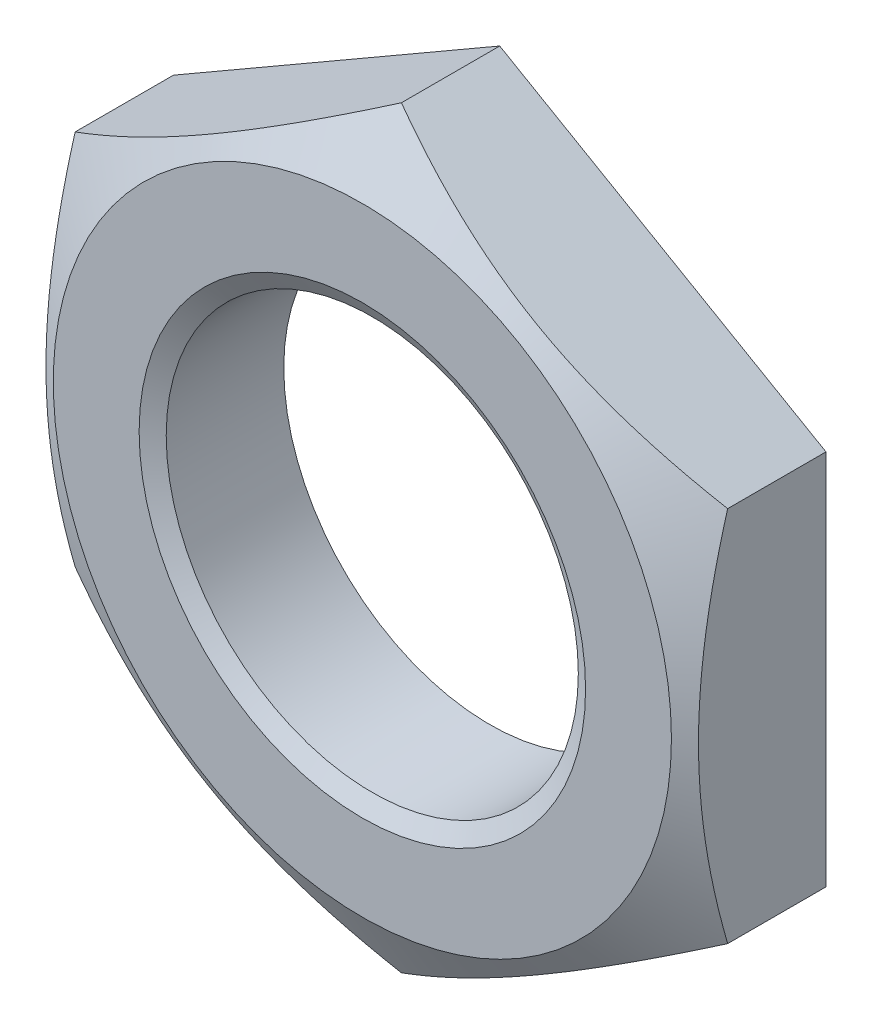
ISO-10303-21;
HEADER;
FILE_DESCRIPTION(('STEP AP214'),'2;1');
FILE_NAME('part.step','',(''),(''),'','','');
FILE_SCHEMA(('AUTOMOTIVE_DESIGN { 1 0 10303 214 1 1 1 1 }'));
ENDSEC;
DATA;
#1=APPLICATION_CONTEXT('core data for automotive mechanical design processes');
#2=APPLICATION_PROTOCOL_DEFINITION('international standard','automotive_design',2000,#1);
#3=PRODUCT_CONTEXT('',#1,'mechanical');
#4=PRODUCT('Part','Part','',(#3));
#5=PRODUCT_RELATED_PRODUCT_CATEGORY('part','',(#4));
#6=PRODUCT_DEFINITION_FORMATION('','',#4);
#7=PRODUCT_DEFINITION_CONTEXT('part definition',#1,'design');
#8=PRODUCT_DEFINITION('design','',#6,#7);
#9=PRODUCT_DEFINITION_SHAPE('','',#8);
#10=(LENGTH_UNIT() NAMED_UNIT(*) SI_UNIT(.MILLI.,.METRE.));
#11=(NAMED_UNIT(*) PLANE_ANGLE_UNIT() SI_UNIT($,.RADIAN.));
#12=(NAMED_UNIT(*) SI_UNIT($,.STERADIAN.) SOLID_ANGLE_UNIT());
#13=UNCERTAINTY_MEASURE_WITH_UNIT(LENGTH_MEASURE(1.E-05),#10,'distance_accuracy_value','');
#14=(GEOMETRIC_REPRESENTATION_CONTEXT(3) GLOBAL_UNCERTAINTY_ASSIGNED_CONTEXT((#13)) GLOBAL_UNIT_ASSIGNED_CONTEXT((#10,
#11,#12)) REPRESENTATION_CONTEXT('',''));
#15=CARTESIAN_POINT('',(0.,0.,0.));
#16=DIRECTION('',(0.,0.,1.));
#17=DIRECTION('',(1.,0.,0.));
#18=AXIS2_PLACEMENT_3D('',#15,#16,#17);
#19=CARTESIAN_POINT('',(9.5,5.48482755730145,4.));
#20=DIRECTION('',(-0.5,-0.866025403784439,0.));
#21=DIRECTION('',(0.866025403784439,-0.5,0.));
#22=AXIS2_PLACEMENT_3D('',#19,#20,#21);
#23=PLANE('',#22);
#24=CARTESIAN_POINT('',(9.5002,5.48471208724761,2.86275242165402));
#25=CARTESIAN_POINT('',(9.2913692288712,5.6052805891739,2.93235142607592));
#26=CARTESIAN_POINT('',(9.08175982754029,5.72629863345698,2.99879155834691));
#27=CARTESIAN_POINT('',(8.66086011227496,5.96930519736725,3.1244775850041));
#28=CARTESIAN_POINT('',(8.44956926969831,6.09129402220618,3.18372111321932));
#29=CARTESIAN_POINT('',(7.81229220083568,6.4592261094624,3.34951029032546));
#30=CARTESIAN_POINT('',(7.38379023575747,6.70662183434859,3.44381042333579));
#31=CARTESIAN_POINT('',(6.74255666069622,7.07683821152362,3.55438616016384));
#32=CARTESIAN_POINT('',(6.53174078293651,7.19855281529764,3.58588503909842));
#33=CARTESIAN_POINT('',(6.10913296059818,7.44254555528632,3.63870666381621));
#34=CARTESIAN_POINT('',(5.89734099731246,7.56482370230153,3.66002921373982));
#35=CARTESIAN_POINT('',(5.4734037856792,7.80958396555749,3.69195184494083));
#36=CARTESIAN_POINT('',(5.26125925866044,7.93206566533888,3.70256466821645));
#37=CARTESIAN_POINT('',(4.83677424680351,8.17714220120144,3.71284233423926));
#38=CARTESIAN_POINT('',(4.62443376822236,8.29973703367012,3.71250751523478));
#39=CARTESIAN_POINT('',(4.22745800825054,8.52893109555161,3.70165149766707));
#40=CARTESIAN_POINT('',(4.04279470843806,8.63554650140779,3.69245459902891));
#41=CARTESIAN_POINT('',(3.67389999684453,8.84852796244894,3.6659594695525));
#42=CARTESIAN_POINT('',(3.48966861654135,8.95489399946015,3.64866066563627));
#43=CARTESIAN_POINT('',(2.93768832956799,9.27357996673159,3.58502038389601));
#44=CARTESIAN_POINT('',(2.57091646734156,9.4853358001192,3.52694296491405));
#45=CARTESIAN_POINT('',(1.83348217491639,9.91109368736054,3.38174885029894));
#46=CARTESIAN_POINT('',(1.46291385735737,10.1250414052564,3.29401669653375));
#47=CARTESIAN_POINT('',(0.727303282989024,10.5497463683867,3.0949011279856));
#48=CARTESIAN_POINT('',(0.362251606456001,10.7605090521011,2.98356447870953));
#49=CARTESIAN_POINT('',(-0.000199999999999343,10.9697705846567,2.86275242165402));
#50=B_SPLINE_CURVE_WITH_KNOTS('',3,(#24,#25,#26,#27,#28,#29,#30,#31,#32,#33,#34,#35,#36,#37,#38,
#39,#40,#41,#42,#43,#44,#45,#46,#47,#48,#49),.UNSPECIFIED.,.F.,.F.,(4,2,2,2,2,2,2,2,2,2,2,2,4),
(0.,0.752880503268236,1.50600787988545,3.0154687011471,3.75167336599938,4.48789219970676,
5.22323407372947,5.95855322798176,6.59868084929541,7.23885375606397,8.52010929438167,
9.82978009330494,11.1368800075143),.UNSPECIFIED.);
#51=CARTESIAN_POINT('',(9.5,5.48482755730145,2.86281908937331));
#52=VERTEX_POINT('',#51);
#53=CARTESIAN_POINT('',(0.,10.9696551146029,2.86281908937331));
#54=VERTEX_POINT('',#53);
#55=EDGE_CURVE('E69',#52,#54,#50,.T.);
#56=ORIENTED_EDGE('',*,*,#55,.F.);
#57=DIRECTION('',(0.,0.,-1.));
#58=VECTOR('',#57,1.);
#59=CARTESIAN_POINT('',(9.5,5.48482755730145,4.));
#60=LINE('',#59,#58);
#61=CARTESIAN_POINT('',(9.5,5.48482755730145,0.));
#62=VERTEX_POINT('',#61);
#63=EDGE_CURVE('E38',#52,#62,#60,.T.);
#64=ORIENTED_EDGE('',*,*,#63,.T.);
#65=DIRECTION('',(-0.866025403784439,0.5,0.));
#66=VECTOR('',#65,1.);
#67=CARTESIAN_POINT('',(9.5,5.48482755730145,0.));
#68=LINE('',#67,#66);
#69=CARTESIAN_POINT('',(0.,10.9696551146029,0.));
#70=VERTEX_POINT('',#69);
#71=EDGE_CURVE('E77',#62,#70,#68,.T.);
#72=ORIENTED_EDGE('',*,*,#71,.T.);
#73=DIRECTION('',(0.,0.,-1.));
#74=VECTOR('',#73,1.);
#75=CARTESIAN_POINT('',(0.,10.9696551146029,4.));
#76=LINE('',#75,#74);
#77=EDGE_CURVE('E76',#54,#70,#76,.T.);
#78=ORIENTED_EDGE('',*,*,#77,.F.);
#79=EDGE_LOOP('',(#56,#64,#72,#78));
#80=FACE_BOUND('',#79,.T.);
#81=ADVANCED_FACE('F14',(#80),#23,.F.);
#82=CARTESIAN_POINT('',(0.,10.9696551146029,4.));
#83=DIRECTION('',(0.5,-0.866025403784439,0.));
#84=DIRECTION('',(0.866025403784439,0.5,0.));
#85=AXIS2_PLACEMENT_3D('',#82,#83,#84);
#86=PLANE('',#85);
#87=CARTESIAN_POINT('',(0.000200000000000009,10.9697705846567,2.86275242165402));
#88=CARTESIAN_POINT('',(-0.208630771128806,10.8492020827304,2.93235142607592));
#89=CARTESIAN_POINT('',(-0.418240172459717,10.7281840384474,2.99879155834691));
#90=CARTESIAN_POINT('',(-0.839139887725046,10.4851774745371,3.1244775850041));
#91=CARTESIAN_POINT('',(-1.05043073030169,10.3631886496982,3.18372111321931));
#92=CARTESIAN_POINT('',(-1.68770779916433,9.99525656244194,3.34951029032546));
#93=CARTESIAN_POINT('',(-2.11620976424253,9.74786083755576,3.44381042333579));
#94=CARTESIAN_POINT('',(-2.75744333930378,9.37764446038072,3.55438616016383));
#95=CARTESIAN_POINT('',(-2.9682592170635,9.2559298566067,3.58588503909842));
#96=CARTESIAN_POINT('',(-3.39086703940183,9.01193711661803,3.6387066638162));
#97=CARTESIAN_POINT('',(-3.60265900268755,8.88965896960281,3.66002921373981));
#98=CARTESIAN_POINT('',(-4.0265962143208,8.64489870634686,3.69195184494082));
#99=CARTESIAN_POINT('',(-4.23874074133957,8.52241700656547,3.70256466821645));
#100=CARTESIAN_POINT('',(-4.66322575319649,8.27734047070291,3.71284233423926));
#101=CARTESIAN_POINT('',(-4.87556623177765,8.15474563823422,3.71250751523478));
#102=CARTESIAN_POINT('',(-5.27254199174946,7.92555157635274,3.70165149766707));
#103=CARTESIAN_POINT('',(-5.45720529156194,7.81893617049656,3.6924545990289));
#104=CARTESIAN_POINT('',(-5.82610000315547,7.60595470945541,3.6659594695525));
#105=CARTESIAN_POINT('',(-6.01033138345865,7.49958867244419,3.64866066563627));
#106=CARTESIAN_POINT('',(-6.56231167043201,7.18090270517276,3.585020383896));
#107=CARTESIAN_POINT('',(-6.92908353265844,6.96914687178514,3.52694296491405));
#108=CARTESIAN_POINT('',(-7.66651782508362,6.54338898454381,3.38174885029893));
#109=CARTESIAN_POINT('',(-8.03708614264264,6.32944126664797,3.29401669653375));
#110=CARTESIAN_POINT('',(-8.77269671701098,5.90473630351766,3.0949011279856));
#111=CARTESIAN_POINT('',(-9.13774839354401,5.6939736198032,2.98356447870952));
#112=CARTESIAN_POINT('',(-9.5002,5.48471208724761,2.86275242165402));
#113=B_SPLINE_CURVE_WITH_KNOTS('',3,(#87,#88,#89,#90,#91,#92,#93,#94,#95,#96,#97,#98,#99,#100,
#101,#102,#103,#104,#105,#106,#107,#108,#109,#110,#111,#112),.UNSPECIFIED.,.F.,.F.,(4,2,2,2,2,2,
2,2,2,2,2,2,4),(0.,0.752880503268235,1.50600787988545,3.0154687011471,3.75167336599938,
4.48789219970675,5.22323407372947,5.95855322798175,6.59868084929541,7.23885375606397,
8.52010929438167,9.82978009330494,11.1368800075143),.UNSPECIFIED.);
#114=CARTESIAN_POINT('',(-9.5,5.48482755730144,2.86281908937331));
#115=VERTEX_POINT('',#114);
#116=EDGE_CURVE('E78',#54,#115,#113,.T.);
#117=ORIENTED_EDGE('',*,*,#116,.F.);
#118=ORIENTED_EDGE('',*,*,#77,.T.);
#119=DIRECTION('',(-0.866025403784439,-0.5,0.));
#120=VECTOR('',#119,1.);
#121=CARTESIAN_POINT('',(0.,10.9696551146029,0.));
#122=LINE('',#121,#120);
#123=CARTESIAN_POINT('',(-9.5,5.48482755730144,0.));
#124=VERTEX_POINT('',#123);
#125=EDGE_CURVE('E292',#70,#124,#122,.T.);
#126=ORIENTED_EDGE('',*,*,#125,.T.);
#127=DIRECTION('',(0.,0.,-1.));
#128=VECTOR('',#127,1.);
#129=CARTESIAN_POINT('',(-9.5,5.48482755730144,4.));
#130=LINE('',#129,#128);
#131=EDGE_CURVE('E95',#115,#124,#130,.T.);
#132=ORIENTED_EDGE('',*,*,#131,.F.);
#133=EDGE_LOOP('',(#117,#118,#126,#132));
#134=FACE_BOUND('',#133,.T.);
#135=ADVANCED_FACE('F120',(#134),#86,.F.);
#136=CARTESIAN_POINT('',(-9.5,5.48482755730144,4.));
#137=DIRECTION('',(1.,0.,0.));
#138=DIRECTION('',(0.,1.,0.));
#139=AXIS2_PLACEMENT_3D('',#136,#137,#138);
#140=PLANE('',#139);
#141=CARTESIAN_POINT('',(-9.5,-14.9066515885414,-1.00937323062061));
#142=CARTESIAN_POINT('',(-9.5,-14.6984463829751,-0.908003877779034));
#143=CARTESIAN_POINT('',(-9.5,-14.4900014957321,-0.807127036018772));
#144=CARTESIAN_POINT('',(-9.5,-14.0725824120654,-0.606469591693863));
#145=CARTESIAN_POINT('',(-9.5,-13.8636082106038,-0.506688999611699));
#146=CARTESIAN_POINT('',(-9.5,-13.2357633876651,-0.209133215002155));
#147=CARTESIAN_POINT('',(-9.5,-12.8160295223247,-0.0131728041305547));
#148=CARTESIAN_POINT('',(-9.5,-11.9716081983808,0.373774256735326));
#149=CARTESIAN_POINT('',(-9.5,-11.5469063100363,0.564729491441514));
#150=CARTESIAN_POINT('',(-9.5,-10.6941855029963,0.939056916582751));
#151=CARTESIAN_POINT('',(-9.5,-10.2661667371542,1.12242945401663));
#152=CARTESIAN_POINT('',(-9.5,-9.39168027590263,1.48559160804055));
#153=CARTESIAN_POINT('',(-9.5,-8.94507589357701,1.6650538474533));
#154=CARTESIAN_POINT('',(-9.5,-8.04670787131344,2.01081216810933));
#155=CARTESIAN_POINT('',(-9.5,-7.59494366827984,2.17710679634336));
#156=CARTESIAN_POINT('',(-9.5,-6.68632253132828,2.49229063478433));
#157=CARTESIAN_POINT('',(-9.5,-6.22947743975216,2.64121362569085));
#158=CARTESIAN_POINT('',(-9.5,-5.30925203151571,2.91699239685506));
#159=CARTESIAN_POINT('',(-9.5,-4.84587376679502,3.04385494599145));
#160=CARTESIAN_POINT('',(-9.5,-3.91484052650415,3.26885134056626));
#161=CARTESIAN_POINT('',(-9.5,-3.44722565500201,3.36714672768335));
#162=CARTESIAN_POINT('',(-9.5,-2.74140946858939,3.48899796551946));
#163=CARTESIAN_POINT('',(-9.5,-2.50538909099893,3.52535131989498));
#164=CARTESIAN_POINT('',(-9.5,-2.03211705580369,3.5888188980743));
#165=CARTESIAN_POINT('',(-9.5,-1.79486551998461,3.61593401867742));
#166=CARTESIAN_POINT('',(-9.5,-1.32262463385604,3.66003547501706));
#167=CARTESIAN_POINT('',(-9.5,-1.0876475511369,3.67715262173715));
#168=CARTESIAN_POINT('',(-9.5,-0.617179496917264,3.70142691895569));
#169=CARTESIAN_POINT('',(-9.5,-0.381688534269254,3.70858423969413));
#170=CARTESIAN_POINT('',(-9.5,0.0893855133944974,3.71276742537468));
#171=CARTESIAN_POINT('',(-9.5,0.324968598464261,3.70979328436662));
#172=CARTESIAN_POINT('',(-9.5,0.795795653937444,3.69378836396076));
#173=CARTESIAN_POINT('',(-9.5,1.03103960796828,3.68075711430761));
#174=CARTESIAN_POINT('',(-9.5,1.59119520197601,3.63803355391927));
#175=CARTESIAN_POINT('',(-9.5,1.91577269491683,3.60385922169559));
#176=CARTESIAN_POINT('',(-9.5,2.56261646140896,3.51819023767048));
#177=CARTESIAN_POINT('',(-9.5,2.88488243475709,3.46669337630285));
#178=CARTESIAN_POINT('',(-9.5,3.84778787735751,3.28894140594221));
#179=CARTESIAN_POINT('',(-9.5,4.48420090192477,3.13945384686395));
#180=CARTESIAN_POINT('',(-9.5,5.43609460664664,2.87896561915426));
#181=CARTESIAN_POINT('',(-9.5,5.75647770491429,2.7848382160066));
#182=CARTESIAN_POINT('',(-9.5,6.39413527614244,2.58649129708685));
#183=CARTESIAN_POINT('',(-9.5,6.71140972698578,2.48227170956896));
#184=CARTESIAN_POINT('',(-9.5,7.34294447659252,2.26543869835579));
#185=CARTESIAN_POINT('',(-9.5,7.65720564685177,2.15282778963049));
#186=CARTESIAN_POINT('',(-9.5,8.28310242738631,1.92056856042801));
#187=CARTESIAN_POINT('',(-9.5,8.59473808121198,1.80092035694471));
#188=CARTESIAN_POINT('',(-9.5,9.37702007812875,1.49204599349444));
#189=CARTESIAN_POINT('',(-9.5,9.8461452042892,1.29897240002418));
#190=CARTESIAN_POINT('',(-9.5,10.7799895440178,0.902414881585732));
#191=CARTESIAN_POINT('',(-9.5,11.2447083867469,0.698930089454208));
#192=CARTESIAN_POINT('',(-9.5,12.1706468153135,0.283809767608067));
#193=CARTESIAN_POINT('',(-9.5,12.631865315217,0.0721718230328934));
#194=CARTESIAN_POINT('',(-9.5,13.5513033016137,-0.35746781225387));
#195=CARTESIAN_POINT('',(-9.5,14.0095228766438,-0.575469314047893));
#196=CARTESIAN_POINT('',(-9.5,14.9241201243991,-1.01685074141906));
#197=CARTESIAN_POINT('',(-9.5,15.3804944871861,-1.24023751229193));
#198=CARTESIAN_POINT('',(-9.5,16.2912057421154,-1.69112677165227));
#199=CARTESIAN_POINT('',(-9.5,16.7455426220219,-1.91862928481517));
#200=CARTESIAN_POINT('',(-9.5,17.6524379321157,-2.37695593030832));
#201=CARTESIAN_POINT('',(-9.5,18.1049966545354,-2.60777948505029));
#202=CARTESIAN_POINT('',(-9.5,19.0086865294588,-3.07220595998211));
#203=CARTESIAN_POINT('',(-9.5,19.4598176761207,-3.30580889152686));
#204=CARTESIAN_POINT('',(-9.5,20.7266231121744,-3.96590001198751));
#205=CARTESIAN_POINT('',(-9.5,21.5409251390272,-4.39502145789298));
#206=CARTESIAN_POINT('',(-9.5,23.166605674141,-5.25884581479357));
#207=CARTESIAN_POINT('',(-9.5,23.9779840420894,-5.69354898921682));
#208=CARTESIAN_POINT('',(-9.5,25.5960789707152,-6.56588740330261));
#209=CARTESIAN_POINT('',(-9.5,26.4028022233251,-7.00351023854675));
#210=CARTESIAN_POINT('',(-9.5,27.6115303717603,-7.66236739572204));
#211=CARTESIAN_POINT('',(-9.5,28.0142005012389,-7.88238303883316));
#212=CARTESIAN_POINT('',(-9.5,28.8191430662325,-8.32313931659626));
#213=CARTESIAN_POINT('',(-9.5,29.2214155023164,-8.54387995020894));
#214=CARTESIAN_POINT('',(-9.5,29.6235125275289,-8.76493973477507));
#215=B_SPLINE_CURVE_WITH_KNOTS('',3,(#141,#142,#143,#144,#145,#146,#147,#148,#149,#150,#151,
#152,#153,#154,#155,#156,#157,#158,#159,#160,#161,#162,#163,#164,#165,#166,#167,#168,#169,#170,
#171,#172,#173,#174,#175,#176,#177,#178,#179,#180,#181,#182,#183,#184,#185,#186,#187,#188,#189,
#190,#191,#192,#193,#194,#195,#196,#197,#198,#199,#200,#201,#202,#203,#204,#205,#206,#207,#208,
#209,#210,#211,#212,#213,#214),.UNSPECIFIED.,.F.,.F.,(4,2,2,2,2,2,2,2,2,2,2,2,2,2,2,2,2,2,2,2,2,
2,2,2,2,2,2,2,2,2,2,2,2,2,2,2,4),(0.,0.694711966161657,1.38943056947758,2.77906464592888,
4.17597490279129,5.57282116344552,7.01659889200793,8.46053571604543,9.90161613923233,
11.3422536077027,12.774578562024,13.4908372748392,14.2070264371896,14.9136221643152,
15.6202058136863,16.3267898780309,17.0334069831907,18.0119725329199,18.9906629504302,
20.9490448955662,21.9507288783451,22.9524199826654,23.9538120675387,24.9551875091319,
26.4769169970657,27.9987734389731,29.5210841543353,31.0433497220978,32.5676645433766,
34.0919885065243,35.6160504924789,37.140118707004,39.9014432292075,42.662898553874,
45.4162217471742,46.7927934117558,48.1693631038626),.UNSPECIFIED.);
#216=CARTESIAN_POINT('',(-9.5,-5.48482755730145,2.86281908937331));
#217=VERTEX_POINT('',#216);
#218=EDGE_CURVE('E172',#115,#217,#215,.F.);
#219=ORIENTED_EDGE('',*,*,#218,.F.);
#220=ORIENTED_EDGE('',*,*,#131,.T.);
#221=DIRECTION('',(0.,-1.,0.));
#222=VECTOR('',#221,1.);
#223=CARTESIAN_POINT('',(-9.5,5.48482755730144,0.));
#224=LINE('',#223,#222);
#225=CARTESIAN_POINT('',(-9.5,-5.48482755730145,0.));
#226=VERTEX_POINT('',#225);
#227=EDGE_CURVE('E289',#124,#226,#224,.T.);
#228=ORIENTED_EDGE('',*,*,#227,.T.);
#229=DIRECTION('',(0.,0.,-1.));
#230=VECTOR('',#229,1.);
#231=CARTESIAN_POINT('',(-9.5,-5.48482755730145,4.));
#232=LINE('',#231,#230);
#233=EDGE_CURVE('E93',#217,#226,#232,.T.);
#234=ORIENTED_EDGE('',*,*,#233,.F.);
#235=EDGE_LOOP('',(#219,#220,#228,#234));
#236=FACE_BOUND('',#235,.T.);
#237=ADVANCED_FACE('F125',(#236),#140,.F.);
#238=CARTESIAN_POINT('',(-9.5,-5.48482755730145,4.));
#239=DIRECTION('',(0.5,0.866025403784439,0.));
#240=DIRECTION('',(-0.866025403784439,0.5,0.));
#241=AXIS2_PLACEMENT_3D('',#238,#239,#240);
#242=PLANE('',#241);
#243=CARTESIAN_POINT('',(-9.5002,-5.48471208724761,2.86275242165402));
#244=CARTESIAN_POINT('',(-9.2913692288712,-5.6052805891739,2.93235142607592));
#245=CARTESIAN_POINT('',(-9.08175982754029,-5.72629863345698,2.99879155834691));
#246=CARTESIAN_POINT('',(-8.66086011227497,-5.96930519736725,3.1244775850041));
#247=CARTESIAN_POINT('',(-8.44956926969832,-6.09129402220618,3.18372111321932));
#248=CARTESIAN_POINT('',(-7.81229220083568,-6.4592261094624,3.34951029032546));
#249=CARTESIAN_POINT('',(-7.38379023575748,-6.70662183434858,3.44381042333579));
#250=CARTESIAN_POINT('',(-6.74255666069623,-7.07683821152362,3.55438616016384));
#251=CARTESIAN_POINT('',(-6.53174078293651,-7.19855281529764,3.58588503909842));
#252=CARTESIAN_POINT('',(-6.10913296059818,-7.44254555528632,3.63870666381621));
#253=CARTESIAN_POINT('',(-5.89734099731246,-7.56482370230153,3.66002921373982));
#254=CARTESIAN_POINT('',(-5.47340378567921,-7.80958396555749,3.69195184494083));
#255=CARTESIAN_POINT('',(-5.26125925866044,-7.93206566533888,3.70256466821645));
#256=CARTESIAN_POINT('',(-4.83677424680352,-8.17714220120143,3.71284233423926));
#257=CARTESIAN_POINT('',(-4.62443376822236,-8.29973703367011,3.71250751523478));
#258=CARTESIAN_POINT('',(-4.22745800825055,-8.5289310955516,3.70165149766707));
#259=CARTESIAN_POINT('',(-4.04279470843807,-8.63554650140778,3.69245459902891));
#260=CARTESIAN_POINT('',(-3.67389999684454,-8.84852796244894,3.6659594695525));
#261=CARTESIAN_POINT('',(-3.48966861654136,-8.95489399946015,3.64866066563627));
#262=CARTESIAN_POINT('',(-2.937688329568,-9.27357996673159,3.58502038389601));
#263=CARTESIAN_POINT('',(-2.57091646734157,-9.4853358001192,3.52694296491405));
#264=CARTESIAN_POINT('',(-1.83348217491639,-9.91109368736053,3.38174885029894));
#265=CARTESIAN_POINT('',(-1.46291385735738,-10.1250414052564,3.29401669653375));
#266=CARTESIAN_POINT('',(-0.727303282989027,-10.5497463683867,3.09490112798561));
#267=CARTESIAN_POINT('',(-0.362251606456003,-10.7605090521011,2.98356447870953));
#268=CARTESIAN_POINT('',(0.00019999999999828,-10.9697705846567,2.86275242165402));
#269=B_SPLINE_CURVE_WITH_KNOTS('',3,(#243,#244,#245,#246,#247,#248,#249,#250,#251,#252,#253,
#254,#255,#256,#257,#258,#259,#260,#261,#262,#263,#264,#265,#266,#267,#268),.UNSPECIFIED.,.F.,
.F.,(4,2,2,2,2,2,2,2,2,2,2,2,4),(0.,0.752880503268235,1.50600787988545,3.0154687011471,
3.75167336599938,4.48789219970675,5.22323407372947,5.95855322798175,6.59868084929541,
7.23885375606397,8.52010929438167,9.82978009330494,11.1368800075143),.UNSPECIFIED.);
#270=CARTESIAN_POINT('',(0.,-10.9696551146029,2.86281908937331));
#271=VERTEX_POINT('',#270);
#272=EDGE_CURVE('E166',#217,#271,#269,.T.);
#273=ORIENTED_EDGE('',*,*,#272,.F.);
#274=ORIENTED_EDGE('',*,*,#233,.T.);
#275=DIRECTION('',(0.866025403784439,-0.5,0.));
#276=VECTOR('',#275,1.);
#277=CARTESIAN_POINT('',(-9.5,-5.48482755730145,0.));
#278=LINE('',#277,#276);
#279=CARTESIAN_POINT('',(0.,-10.9696551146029,0.));
#280=VERTEX_POINT('',#279);
#281=EDGE_CURVE('E285',#226,#280,#278,.T.);
#282=ORIENTED_EDGE('',*,*,#281,.T.);
#283=DIRECTION('',(0.,0.,-1.));
#284=VECTOR('',#283,1.);
#285=CARTESIAN_POINT('',(0.,-10.9696551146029,4.));
#286=LINE('',#285,#284);
#287=EDGE_CURVE('E86',#271,#280,#286,.T.);
#288=ORIENTED_EDGE('',*,*,#287,.F.);
#289=EDGE_LOOP('',(#273,#274,#282,#288));
#290=FACE_BOUND('',#289,.T.);
#291=ADVANCED_FACE('F179',(#290),#242,.F.);
#292=CARTESIAN_POINT('',(0.,-10.9696551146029,4.));
#293=DIRECTION('',(-0.5,0.866025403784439,0.));
#294=DIRECTION('',(-0.866025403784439,-0.5,0.));
#295=AXIS2_PLACEMENT_3D('',#292,#293,#294);
#296=PLANE('',#295);
#297=CARTESIAN_POINT('',(-0.000200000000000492,-10.9697705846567,2.86275242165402));
#298=CARTESIAN_POINT('',(0.208630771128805,-10.8492020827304,2.93235142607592));
#299=CARTESIAN_POINT('',(0.418240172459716,-10.7281840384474,2.99879155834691));
#300=CARTESIAN_POINT('',(0.839139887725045,-10.4851774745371,3.1244775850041));
#301=CARTESIAN_POINT('',(1.05043073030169,-10.3631886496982,3.18372111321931));
#302=CARTESIAN_POINT('',(1.68770779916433,-9.99525656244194,3.34951029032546));
#303=CARTESIAN_POINT('',(2.11620976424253,-9.74786083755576,3.44381042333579));
#304=CARTESIAN_POINT('',(2.75744333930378,-9.37764446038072,3.55438616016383));
#305=CARTESIAN_POINT('',(2.9682592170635,-9.2559298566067,3.58588503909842));
#306=CARTESIAN_POINT('',(3.39086703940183,-9.01193711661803,3.63870666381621));
#307=CARTESIAN_POINT('',(3.60265900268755,-8.88965896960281,3.66002921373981));
#308=CARTESIAN_POINT('',(4.0265962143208,-8.64489870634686,3.69195184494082));
#309=CARTESIAN_POINT('',(4.23874074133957,-8.52241700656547,3.70256466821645));
#310=CARTESIAN_POINT('',(4.66322575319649,-8.27734047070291,3.71284233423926));
#311=CARTESIAN_POINT('',(4.87556623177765,-8.15474563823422,3.71250751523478));
#312=CARTESIAN_POINT('',(5.27254199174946,-7.92555157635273,3.70165149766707));
#313=CARTESIAN_POINT('',(5.45720529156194,-7.81893617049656,3.6924545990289));
#314=CARTESIAN_POINT('',(5.82610000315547,-7.60595470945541,3.6659594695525));
#315=CARTESIAN_POINT('',(6.01033138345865,-7.49958867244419,3.64866066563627));
#316=CARTESIAN_POINT('',(6.56231167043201,-7.18090270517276,3.585020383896));
#317=CARTESIAN_POINT('',(6.92908353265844,-6.96914687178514,3.52694296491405));
#318=CARTESIAN_POINT('',(7.66651782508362,-6.54338898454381,3.38174885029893));
#319=CARTESIAN_POINT('',(8.03708614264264,-6.32944126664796,3.29401669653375));
#320=CARTESIAN_POINT('',(8.77269671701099,-5.90473630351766,3.0949011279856));
#321=CARTESIAN_POINT('',(9.13774839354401,-5.6939736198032,2.98356447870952));
#322=CARTESIAN_POINT('',(9.5002,-5.48471208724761,2.86275242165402));
#323=B_SPLINE_CURVE_WITH_KNOTS('',3,(#297,#298,#299,#300,#301,#302,#303,#304,#305,#306,#307,
#308,#309,#310,#311,#312,#313,#314,#315,#316,#317,#318,#319,#320,#321,#322),.UNSPECIFIED.,.F.,
.F.,(4,2,2,2,2,2,2,2,2,2,2,2,4),(0.,0.752880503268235,1.50600787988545,3.0154687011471,
3.75167336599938,4.48789219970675,5.22323407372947,5.95855322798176,6.59868084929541,
7.23885375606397,8.52010929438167,9.82978009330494,11.1368800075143),.UNSPECIFIED.);
#324=CARTESIAN_POINT('',(9.5,-5.48482755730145,2.86281908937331));
#325=VERTEX_POINT('',#324);
#326=EDGE_CURVE('E30',#271,#325,#323,.T.);
#327=ORIENTED_EDGE('',*,*,#326,.F.);
#328=ORIENTED_EDGE('',*,*,#287,.T.);
#329=DIRECTION('',(0.866025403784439,0.5,0.));
#330=VECTOR('',#329,1.);
#331=CARTESIAN_POINT('',(0.,-10.9696551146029,0.));
#332=LINE('',#331,#330);
#333=CARTESIAN_POINT('',(9.5,-5.48482755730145,0.));
#334=VERTEX_POINT('',#333);
#335=EDGE_CURVE('E88',#280,#334,#332,.T.);
#336=ORIENTED_EDGE('',*,*,#335,.T.);
#337=DIRECTION('',(0.,0.,-1.));
#338=VECTOR('',#337,1.);
#339=CARTESIAN_POINT('',(9.5,-5.48482755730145,4.));
#340=LINE('',#339,#338);
#341=EDGE_CURVE('E84',#325,#334,#340,.T.);
#342=ORIENTED_EDGE('',*,*,#341,.F.);
#343=EDGE_LOOP('',(#327,#328,#336,#342));
#344=FACE_BOUND('',#343,.T.);
#345=ADVANCED_FACE('F183',(#344),#296,.F.);
#346=CARTESIAN_POINT('',(9.5,-5.48482755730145,4.));
#347=DIRECTION('',(-1.,0.,0.));
#348=DIRECTION('',(0.,-1.,0.));
#349=AXIS2_PLACEMENT_3D('',#346,#347,#348);
#350=PLANE('',#349);
#351=CARTESIAN_POINT('',(9.5,-14.9066515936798,-1.00937323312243));
#352=CARTESIAN_POINT('',(9.5,-14.6984463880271,-0.908003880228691));
#353=CARTESIAN_POINT('',(9.5,-14.4900015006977,-0.807127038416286));
#354=CARTESIAN_POINT('',(9.5,-14.072582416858,-0.606469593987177));
#355=CARTESIAN_POINT('',(9.5,-13.8636082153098,-0.506689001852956));
#356=CARTESIAN_POINT('',(9.5,-13.2357633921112,-0.209133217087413));
#357=CARTESIAN_POINT('',(9.5,-12.8160295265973,-0.0131728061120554));
#358=CARTESIAN_POINT('',(9.5,-11.9716082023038,0.373774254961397));
#359=CARTESIAN_POINT('',(9.5,-11.5469063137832,0.564729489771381));
#360=CARTESIAN_POINT('',(9.5,-10.6941855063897,0.939056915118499));
#361=CARTESIAN_POINT('',(9.5,-10.2661667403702,1.12242945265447));
#362=CARTESIAN_POINT('',(9.5,-9.39168027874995,1.48559160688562));
#363=CARTESIAN_POINT('',(9.5,-8.94507589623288,1.66505384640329));
#364=CARTESIAN_POINT('',(9.5,-8.04670787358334,2.01081216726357));
#365=CARTESIAN_POINT('',(9.5,-7.59494367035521,2.17710679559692));
#366=CARTESIAN_POINT('',(9.5,-6.686322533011,2.49229063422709));
#367=CARTESIAN_POINT('',(9.5,-6.22947744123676,2.64121362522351));
#368=CARTESIAN_POINT('',(9.5,-5.30925203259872,2.91699239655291));
#369=CARTESIAN_POINT('',(9.5,-4.84587376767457,3.04385494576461));
#370=CARTESIAN_POINT('',(9.5,-3.91484052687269,3.26885134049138));
#371=CARTESIAN_POINT('',(9.5,-3.44722565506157,3.36714672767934));
#372=CARTESIAN_POINT('',(9.5,-2.74140946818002,3.48899796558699));
#373=CARTESIAN_POINT('',(9.5,-2.50538909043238,3.52535131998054));
#374=CARTESIAN_POINT('',(9.5,-2.03211705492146,3.58881889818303));
#375=CARTESIAN_POINT('',(9.5,-1.79486551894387,3.61593401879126));
#376=CARTESIAN_POINT('',(9.5,-1.32262463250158,3.66003547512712));
#377=CARTESIAN_POINT('',(9.5,-1.08764754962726,3.67715262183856));
#378=CARTESIAN_POINT('',(9.5,-0.617179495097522,3.70142691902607));
#379=CARTESIAN_POINT('',(9.5,-0.381688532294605,3.70858423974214));
#380=CARTESIAN_POINT('',(9.5,0.0893855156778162,3.71276742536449));
#381=CARTESIAN_POINT('',(9.5,0.324968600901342,3.70979328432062));
#382=CARTESIAN_POINT('',(9.5,0.795795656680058,3.69378836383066));
#383=CARTESIAN_POINT('',(9.5,1.03103961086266,3.68075711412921));
#384=CARTESIAN_POINT('',(9.5,1.59119520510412,3.63803355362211));
#385=CARTESIAN_POINT('',(9.5,1.91577269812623,3.60385922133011));
#386=CARTESIAN_POINT('',(9.5,2.56261646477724,3.51819023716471));
#387=CARTESIAN_POINT('',(9.5,2.88488243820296,3.46669337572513));
#388=CARTESIAN_POINT('',(9.5,3.84778788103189,3.28894140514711));
#389=CARTESIAN_POINT('',(9.5,4.48420090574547,3.13945384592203));
#390=CARTESIAN_POINT('',(9.5,5.43609461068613,2.87896561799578));
#391=CARTESIAN_POINT('',(9.5,5.75647770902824,2.78483821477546));
#392=CARTESIAN_POINT('',(9.5,6.39413528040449,2.58649129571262));
#393=CARTESIAN_POINT('',(9.5,6.71140973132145,2.48227170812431));
#394=CARTESIAN_POINT('',(9.5,7.3429444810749,2.26543869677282));
#395=CARTESIAN_POINT('',(9.5,7.65720565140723,2.15282778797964));
#396=CARTESIAN_POINT('',(9.5,8.28310243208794,1.92056855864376));
#397=CARTESIAN_POINT('',(9.5,8.5947380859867,1.80092035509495));
#398=CARTESIAN_POINT('',(9.5,9.37702008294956,1.49204599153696));
#399=CARTESIAN_POINT('',(9.5,9.8461452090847,1.29897239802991));
#400=CARTESIAN_POINT('',(9.49999999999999,10.7799895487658,0.902414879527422));
#401=CARTESIAN_POINT('',(9.49999999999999,11.2447083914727,0.698930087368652));
#402=CARTESIAN_POINT('',(9.49999999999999,12.1706468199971,0.283809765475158));
#403=CARTESIAN_POINT('',(9.49999999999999,12.6318653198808,0.0721718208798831));
#404=CARTESIAN_POINT('',(9.49999999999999,13.5513033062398,-0.357467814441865));
#405=CARTESIAN_POINT('',(9.49999999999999,14.0095228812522,-0.575469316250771));
#406=CARTESIAN_POINT('',(9.49999999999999,14.9241201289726,-1.01685074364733));
#407=CARTESIAN_POINT('',(9.49999999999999,15.3804944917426,-1.2402375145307));
#408=CARTESIAN_POINT('',(9.49999999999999,16.2912057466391,-1.69112677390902));
#409=CARTESIAN_POINT('',(9.49999999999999,16.7455426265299,-1.9186292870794));
#410=CARTESIAN_POINT('',(9.49999999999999,17.6524379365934,-2.37695593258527));
#411=CARTESIAN_POINT('',(9.49999999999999,18.1049966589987,-2.60777948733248));
#412=CARTESIAN_POINT('',(9.49999999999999,19.0086865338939,-3.07220596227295));
#413=CARTESIAN_POINT('',(9.49999999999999,19.4598176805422,-3.30580889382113));
#414=CARTESIAN_POINT('',(9.49999999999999,20.726623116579,-3.9659000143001));
#415=CARTESIAN_POINT('',(9.49999999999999,21.5409251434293,-4.39502146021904));
#416=CARTESIAN_POINT('',(9.49999999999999,23.1666056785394,-5.25884581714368));
#417=CARTESIAN_POINT('',(9.49999999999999,23.9779840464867,-5.6935489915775));
#418=CARTESIAN_POINT('',(9.49999999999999,25.5960789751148,-6.56588740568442));
#419=CARTESIAN_POINT('',(9.49999999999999,26.4028022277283,-7.00351024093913));
#420=CARTESIAN_POINT('',(9.49999999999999,27.6115303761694,-7.66236739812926));
#421=CARTESIAN_POINT('',(9.49999999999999,28.0142005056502,-7.88238304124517));
#422=CARTESIAN_POINT('',(9.49999999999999,28.8191430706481,-8.32313931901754));
#423=CARTESIAN_POINT('',(9.49999999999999,29.2214155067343,-8.54387995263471));
#424=CARTESIAN_POINT('',(9.5,29.6235125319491,-8.76493973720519));
#425=B_SPLINE_CURVE_WITH_KNOTS('',3,(#351,#352,#353,#354,#355,#356,#357,#358,#359,#360,#361,
#362,#363,#364,#365,#366,#367,#368,#369,#370,#371,#372,#373,#374,#375,#376,#377,#378,#379,#380,
#381,#382,#383,#384,#385,#386,#387,#388,#389,#390,#391,#392,#393,#394,#395,#396,#397,#398,#399,
#400,#401,#402,#403,#404,#405,#406,#407,#408,#409,#410,#411,#412,#413,#414,#415,#416,#417,#418,
#419,#420,#421,#422,#423,#424),.UNSPECIFIED.,.F.,.F.,(4,2,2,2,2,2,2,2,2,2,2,2,2,2,2,2,2,2,2,2,2,
2,2,2,2,2,2,2,2,2,2,2,2,2,2,2,4),(0.,0.694711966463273,1.38943057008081,2.77906464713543,
4.17597490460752,5.57282116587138,7.01659889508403,8.46053571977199,9.90161614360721,
11.3422536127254,12.7745785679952,13.4908372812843,14.2070264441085,14.9136221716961,
15.6202058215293,16.326789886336,17.0334069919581,18.0119725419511,18.9906629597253,
20.9490449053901,21.9507288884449,22.952419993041,23.9538120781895,24.9551875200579,
26.4769170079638,27.9987734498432,29.5210841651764,31.04334973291,32.5676645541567,
34.0919885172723,35.6160505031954,37.1401187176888,39.9014432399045,42.662898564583,
45.4162217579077,46.7927934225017,48.169363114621),.UNSPECIFIED.);
#426=EDGE_CURVE('E67',#325,#52,#425,.T.);
#427=ORIENTED_EDGE('',*,*,#426,.F.);
#428=ORIENTED_EDGE('',*,*,#341,.T.);
#429=DIRECTION('',(0.,1.,0.));
#430=VECTOR('',#429,1.);
#431=CARTESIAN_POINT('',(9.5,-5.48482755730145,0.));
#432=LINE('',#431,#430);
#433=EDGE_CURVE('E82',#334,#62,#432,.T.);
#434=ORIENTED_EDGE('',*,*,#433,.T.);
#435=ORIENTED_EDGE('',*,*,#63,.F.);
#436=EDGE_LOOP('',(#427,#428,#434,#435));
#437=FACE_BOUND('',#436,.T.);
#438=ADVANCED_FACE('F80',(#437),#350,.F.);
#439=CARTESIAN_POINT('',(0.,10.9696551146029,4.));
#440=DIRECTION('',(0.,0.,1.));
#441=DIRECTION('',(1.,0.,0.));
#442=AXIS2_PLACEMENT_3D('',#439,#440,#441);
#443=PLANE('',#442);
#444=CARTESIAN_POINT('',(0.,0.,4.));
#445=DIRECTION('',(0.,0.,1.));
#446=DIRECTION('',(1.,0.,0.));
#447=AXIS2_PLACEMENT_3D('',#444,#445,#446);
#448=CIRCLE('',#447,6.5);
#449=CARTESIAN_POINT('',(6.5,0.,4.));
#450=VERTEX_POINT('',#449);
#451=EDGE_CURVE('E9',#450,#450,#448,.F.);
#452=ORIENTED_EDGE('',*,*,#451,.T.);
#453=EDGE_LOOP('',(#452));
#454=FACE_BOUND('',#453,.T.);
#455=CARTESIAN_POINT('',(0.,0.,4.));
#456=DIRECTION('',(0.,0.,1.));
#457=DIRECTION('',(1.,0.,0.));
#458=AXIS2_PLACEMENT_3D('',#455,#456,#457);
#459=CIRCLE('',#458,9.);
#460=CARTESIAN_POINT('',(9.,0.,4.));
#461=VERTEX_POINT('',#460);
#462=EDGE_CURVE('E73',#461,#461,#459,.T.);
#463=ORIENTED_EDGE('',*,*,#462,.T.);
#464=EDGE_LOOP('',(#463));
#465=FACE_BOUND('',#464,.T.);
#466=ADVANCED_FACE('F146',(#454,#465),#443,.T.);
#467=CARTESIAN_POINT('',(0.,10.9696551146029,0.));
#468=DIRECTION('',(0.,0.,1.));
#469=DIRECTION('',(1.,0.,0.));
#470=AXIS2_PLACEMENT_3D('',#467,#468,#469);
#471=PLANE('',#470);
#472=CARTESIAN_POINT('',(0.,0.,0.));
#473=DIRECTION('',(0.,0.,1.));
#474=DIRECTION('',(1.,0.,0.));
#475=AXIS2_PLACEMENT_3D('',#472,#473,#474);
#476=CIRCLE('',#475,6.5);
#477=CARTESIAN_POINT('',(6.5,0.,0.));
#478=VERTEX_POINT('',#477);
#479=EDGE_CURVE('E23',#478,#478,#476,.T.);
#480=ORIENTED_EDGE('',*,*,#479,.T.);
#481=EDGE_LOOP('',(#480));
#482=FACE_BOUND('',#481,.T.);
#483=ORIENTED_EDGE('',*,*,#71,.F.);
#484=ORIENTED_EDGE('',*,*,#433,.F.);
#485=ORIENTED_EDGE('',*,*,#335,.F.);
#486=ORIENTED_EDGE('',*,*,#281,.F.);
#487=ORIENTED_EDGE('',*,*,#227,.F.);
#488=ORIENTED_EDGE('',*,*,#125,.F.);
#489=EDGE_LOOP('',(#483,#484,#485,#486,#487,#488));
#490=FACE_BOUND('',#489,.T.);
#491=ADVANCED_FACE('F101',(#482,#490),#471,.F.);
#492=CARTESIAN_POINT('',(0.,0.,4.));
#493=DIRECTION('',(0.,0.,-1.));
#494=DIRECTION('',(1.,0.,0.));
#495=AXIS2_PLACEMENT_3D('',#492,#493,#494);
#496=CONICAL_SURFACE('',#495,9.,1.0471975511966);
#497=ORIENTED_EDGE('',*,*,#462,.F.);
#498=EDGE_LOOP('',(#497));
#499=FACE_BOUND('',#498,.T.);
#500=ORIENTED_EDGE('',*,*,#55,.T.);
#501=ORIENTED_EDGE('',*,*,#116,.T.);
#502=ORIENTED_EDGE('',*,*,#218,.T.);
#503=ORIENTED_EDGE('',*,*,#272,.T.);
#504=ORIENTED_EDGE('',*,*,#326,.T.);
#505=ORIENTED_EDGE('',*,*,#426,.T.);
#506=EDGE_LOOP('',(#500,#501,#502,#503,#504,#505));
#507=FACE_BOUND('',#506,.T.);
#508=ADVANCED_FACE('F68',(#499,#507),#496,.T.);
#509=CARTESIAN_POINT('',(0.,0.,0.577350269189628));
#510=DIRECTION('',(0.,0.,-1.));
#511=DIRECTION('',(-1.,0.,0.));
#512=AXIS2_PLACEMENT_3D('',#509,#510,#511);
#513=CONICAL_SURFACE('',#512,5.5,1.0471975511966);
#514=CARTESIAN_POINT('',(0.,0.,0.288675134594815));
#515=DIRECTION('',(0.,0.,-1.));
#516=DIRECTION('',(-1.,0.,0.));
#517=AXIS2_PLACEMENT_3D('',#514,#515,#516);
#518=CIRCLE('',#517,6.);
#519=CARTESIAN_POINT('',(-6.,0.,0.288675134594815));
#520=VERTEX_POINT('',#519);
#521=EDGE_CURVE('E203',#520,#520,#518,.T.);
#522=ORIENTED_EDGE('',*,*,#521,.F.);
#523=EDGE_LOOP('',(#522));
#524=FACE_BOUND('',#523,.T.);
#525=ORIENTED_EDGE('',*,*,#479,.F.);
#526=EDGE_LOOP('',(#525));
#527=FACE_BOUND('',#526,.T.);
#528=ADVANCED_FACE('F104',(#524,#527),#513,.F.);
#529=CARTESIAN_POINT('',(0.,0.,4.));
#530=DIRECTION('',(0.,0.,1.));
#531=DIRECTION('',(1.,0.,0.));
#532=AXIS2_PLACEMENT_3D('',#529,#530,#531);
#533=CONICAL_SURFACE('',#532,6.5,1.0471975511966);
#534=CARTESIAN_POINT('',(0.,0.,3.71132486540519));
#535=DIRECTION('',(0.,0.,1.));
#536=DIRECTION('',(1.,0.,0.));
#537=AXIS2_PLACEMENT_3D('',#534,#535,#536);
#538=CIRCLE('',#537,6.);
#539=CARTESIAN_POINT('',(6.,0.,3.71132486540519));
#540=VERTEX_POINT('',#539);
#541=EDGE_CURVE('E18',#540,#540,#538,.T.);
#542=ORIENTED_EDGE('',*,*,#541,.F.);
#543=EDGE_LOOP('',(#542));
#544=FACE_BOUND('',#543,.T.);
#545=ORIENTED_EDGE('',*,*,#451,.F.);
#546=EDGE_LOOP('',(#545));
#547=FACE_BOUND('',#546,.T.);
#548=ADVANCED_FACE('F16',(#544,#547),#533,.F.);
#549=CARTESIAN_POINT('',(0.,0.,10.));
#550=DIRECTION('',(0.,0.,-1.));
#551=DIRECTION('',(-1.,0.,0.));
#552=AXIS2_PLACEMENT_3D('',#549,#550,#551);
#553=CYLINDRICAL_SURFACE('',#552,6.);
#554=ORIENTED_EDGE('',*,*,#521,.T.);
#555=EDGE_LOOP('',(#554));
#556=FACE_BOUND('',#555,.T.);
#557=ORIENTED_EDGE('',*,*,#541,.T.);
#558=EDGE_LOOP('',(#557));
#559=FACE_BOUND('',#558,.T.);
#560=ADVANCED_FACE('F113',(#556,#559),#553,.F.);
#561=CLOSED_SHELL('',(#81,#135,#237,#291,#345,#438,#466,#491,#508,#528,#548,#560));
#562=MANIFOLD_SOLID_BREP('B1',#561);
#563=ADVANCED_BREP_SHAPE_REPRESENTATION('',(#18,#562),#14);
#564=SHAPE_DEFINITION_REPRESENTATION(#9,#563);
ENDSEC;
END-ISO-10303-21;
